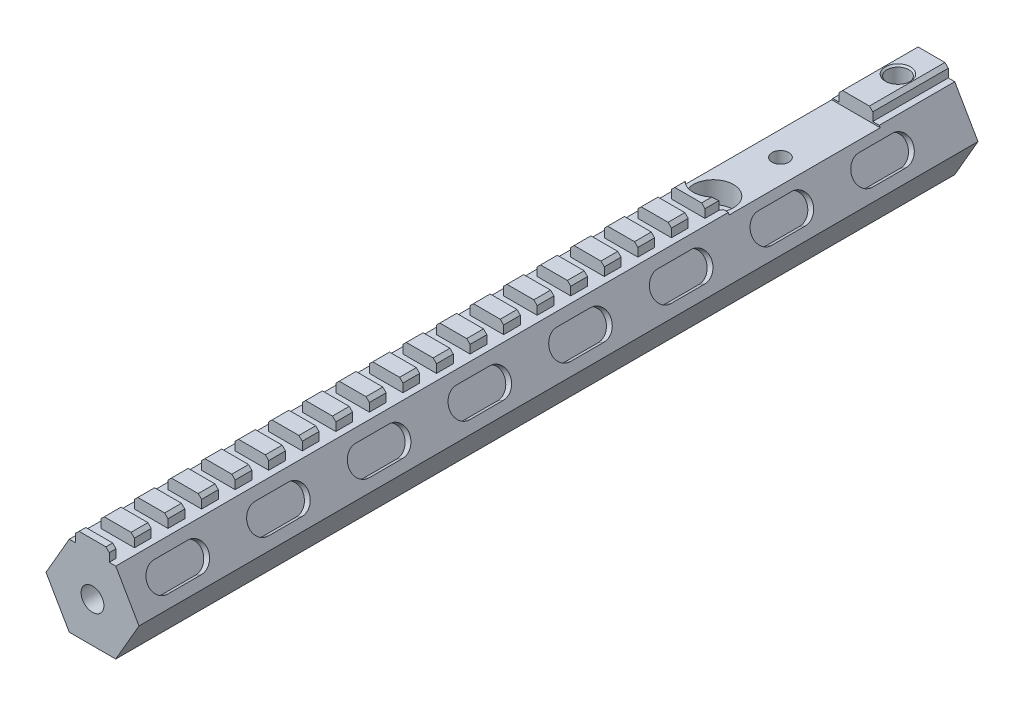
from build123d import *

# Parameters (mm, degrees)
EXTRUDE_1_DEPTH          = 250
SKETCH_2_W               = 10
SKETCH_2_H               = 7
EXTRUDE_2_DEPTH          = 22.5
CHAMFER_3_SIZE           = 1
EXTRUDE_START            = -67.5
EXTRUDE_3_DEPTH          = 5
PATTERN_LINEAR_1_COUNT   = 18
PATTERN_LINEAR_1_PITCH   = 10
EXTRUDE_START_2          = 7.5
EXTRUDE_4_DEPTH          = 2
CUT_EXTRUDE_1_DEPTH      = 2
PATTERN_LINEAR_2_COUNT   = 8
PATTERN_LINEAR_2_PITCH   = 30
MIRROR_1_COPY_1_DEPTH    = 2
MIRROR_1_COPY_2_DEPTH    = 2
MIRROR_1_COPY_3_DEPTH    = 2
MIRROR_1_COPY_4_DEPTH    = 2
MIRROR_1_COPY_5_DEPTH    = 2
MIRROR_1_COPY_6_DEPTH    = 2
MIRROR_1_COPY_7_DEPTH    = 2
CUT_EXTRUDE_2_DEPTH      = 21
CUT_EXTRUDE_3_REACH      = 253.889
SKETCH_12_R              = 3.25
CHAMFER_5_SIZE           = 0.5
HOLE_WIZARD_M8_1_D       = 6.8
HOLE_WIZARD_M8_1_DEPTH   = 25
HOLE_WIZARD_M8_1_TIP     = 2.042926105
HOLE_WIZARD_M6_1_D       = 5
HOLE_WIZARD_M6_1_DEPTH   = 15
HOLE_WIZARD_M6_1_TIP     = 1.502151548
CUT_EXTRUDE_4_DEPTH      = 251.863010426
CUT_EXTRUDE_4_DEPTH_BACK = 251.863010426
HOLE_WIZARD_M6_2_D       = 5
HOLE_WIZARD_M6_2_DEPTH   = 15
HOLE_WIZARD_M6_2_TIP     = 1.502151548


with BuildPart() as part:
    # Sketch 1 → Extrude 1 (new body)
    with BuildSketch(Plane.XY):
        Polygon((-13.856406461, 0), (-6.92820323, -12), (6.92820323, -12), (13.856406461, 0), (6.92820323, 12), (-6.92820323, 12), align=None)
    extrude(amount=EXTRUDE_1_DEPTH)

    # Sketch 2 → Extrude 2 (add)
    with BuildSketch(Plane.XY):
        with Locations((0, 12)):
            Rectangle(SKETCH_2_W, SKETCH_2_H)
    extrude(amount=EXTRUDE_2_DEPTH)

    # Chamfer 3
    chamfer_3_edges = [part.edges().sort_by_distance(p)[0] for p in [
        (-5, 15.5, 11.25),
        (5, 15.5, 11.25),
    ]]
    chamfer(chamfer_3_edges, length=CHAMFER_3_SIZE)

    # Sketch 7 → Extrude 3 (add)
    with BuildSketch(Plane(origin=(0, 0, 0), x_dir=(-1, 0, 0), z_dir=(0, 0, -1)).offset(EXTRUDE_START)):
        Polygon((-5, 12), (5, 12), (5, 14.5), (4, 15.5), (-4, 15.5), (-5, 14.5), align=None)
    extrude_3 = extrude(amount=-EXTRUDE_3_DEPTH)

    # Pattern Linear 1: Extrude 3 ×18
    with Locations(*[(0, 0, i * PATTERN_LINEAR_1_PITCH) for i in range(1, PATTERN_LINEAR_1_COUNT)]):
        add(extrude_3)

    # Sketch 8 → Extrude 4 (add)
    with BuildSketch(Plane.XY.offset(242.5).offset(EXTRUDE_START_2)):
        Polygon((5, 12), (5, 14.5), (4, 15.5), (-4, 15.5), (-5, 14.5), (-5, 12), align=None)
    extrude(amount=-EXTRUDE_4_DEPTH)

    # Sketch 10 → Cut-Extrude 1 (cut)
    with BuildSketch(Plane(origin=(-10.392304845, 6, 0), x_dir=(0, 0, 1), z_dir=(-0.8660254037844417, 0.49999999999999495, 0))):
        with BuildLine():
            Line((20, 3.97179677), (30, 3.97179677))
            ThreePointArc((30, 3.97179677), (34, -0.02820323), (30, -4.02820323))
            Line((30, -4.02820323), (20, -4.02820323))
            ThreePointArc((20, -4.02820323), (16, -0.02820323), (20, 3.97179677))
        make_face()
    cut_extrude_1 = extrude(amount=-CUT_EXTRUDE_1_DEPTH, mode=Mode.SUBTRACT)

    # Pattern Linear 2: Cut-Extrude 1 ×8
    with Locations(*[(0, 0, i * PATTERN_LINEAR_2_PITCH) for i in range(1, PATTERN_LINEAR_2_COUNT)]):
        add(cut_extrude_1, mode=Mode.SUBTRACT)

    # Mirror 1: Cut-Extrude 1 across plane
    add(cut_extrude_1.mirror(Plane(origin=(0, 0, 0), x_dir=(0, 0, 1), z_dir=(1, 0, 0))), mode=Mode.SUBTRACT)

    # Mirror 1 copy 1 sketch → Mirror 1 copy 1 (cut)
    with BuildSketch(Plane(origin=(10.392304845, 6, 30), x_dir=(0, 0, 1), z_dir=(0.8660254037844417, 0.49999999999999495, 0))):
        with BuildLine():
            Line((20, -3.97179677), (30, -3.97179677))
            ThreePointArc((30, -3.97179677), (34, 0.02820323), (30, 4.02820323))
            Line((30, 4.02820323), (20, 4.02820323))
            ThreePointArc((20, 4.02820323), (16, 0.02820323), (20, -3.97179677))
        make_face()
    extrude(amount=-MIRROR_1_COPY_1_DEPTH, mode=Mode.SUBTRACT)

    # Mirror 1 copy 2 sketch → Mirror 1 copy 2 (cut)
    with BuildSketch(Plane(origin=(10.392304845, 6, 60), x_dir=(0, 0, 1), z_dir=(0.8660254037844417, 0.49999999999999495, 0))):
        with BuildLine():
            Line((20, -3.97179677), (30, -3.97179677))
            ThreePointArc((30, -3.97179677), (34, 0.02820323), (30, 4.02820323))
            Line((30, 4.02820323), (20, 4.02820323))
            ThreePointArc((20, 4.02820323), (16, 0.02820323), (20, -3.97179677))
        make_face()
    extrude(amount=-MIRROR_1_COPY_2_DEPTH, mode=Mode.SUBTRACT)

    # Mirror 1 copy 3 sketch → Mirror 1 copy 3 (cut)
    with BuildSketch(Plane(origin=(10.392304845, 6, 90), x_dir=(0, 0, 1), z_dir=(0.8660254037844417, 0.49999999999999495, 0))):
        with BuildLine():
            Line((20, -3.97179677), (30, -3.97179677))
            ThreePointArc((30, -3.97179677), (34, 0.02820323), (30, 4.02820323))
            Line((30, 4.02820323), (20, 4.02820323))
            ThreePointArc((20, 4.02820323), (16, 0.02820323), (20, -3.97179677))
        make_face()
    extrude(amount=-MIRROR_1_COPY_3_DEPTH, mode=Mode.SUBTRACT)

    # Mirror 1 copy 4 sketch → Mirror 1 copy 4 (cut)
    with BuildSketch(Plane(origin=(10.392304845, 6, 120), x_dir=(0, 0, 1), z_dir=(0.8660254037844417, 0.49999999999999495, 0))):
        with BuildLine():
            Line((20, -3.97179677), (30, -3.97179677))
            ThreePointArc((30, -3.97179677), (34, 0.02820323), (30, 4.02820323))
            Line((30, 4.02820323), (20, 4.02820323))
            ThreePointArc((20, 4.02820323), (16, 0.02820323), (20, -3.97179677))
        make_face()
    extrude(amount=-MIRROR_1_COPY_4_DEPTH, mode=Mode.SUBTRACT)

    # Mirror 1 copy 5 sketch → Mirror 1 copy 5 (cut)
    with BuildSketch(Plane(origin=(10.392304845, 6, 150), x_dir=(0, 0, 1), z_dir=(0.8660254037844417, 0.49999999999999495, 0))):
        with BuildLine():
            Line((20, -3.97179677), (30, -3.97179677))
            ThreePointArc((30, -3.97179677), (34, 0.02820323), (30, 4.02820323))
            Line((30, 4.02820323), (20, 4.02820323))
            ThreePointArc((20, 4.02820323), (16, 0.02820323), (20, -3.97179677))
        make_face()
    extrude(amount=-MIRROR_1_COPY_5_DEPTH, mode=Mode.SUBTRACT)

    # Mirror 1 copy 6 sketch → Mirror 1 copy 6 (cut)
    with BuildSketch(Plane(origin=(10.392304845, 6, 180), x_dir=(0, 0, 1), z_dir=(0.8660254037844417, 0.49999999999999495, 0))):
        with BuildLine():
            Line((20, -3.97179677), (30, -3.97179677))
            ThreePointArc((30, -3.97179677), (34, 0.02820323), (30, 4.02820323))
            Line((30, 4.02820323), (20, 4.02820323))
            ThreePointArc((20, 4.02820323), (16, 0.02820323), (20, -3.97179677))
        make_face()
    extrude(amount=-MIRROR_1_COPY_6_DEPTH, mode=Mode.SUBTRACT)

    # Mirror 1 copy 7 sketch → Mirror 1 copy 7 (cut)
    with BuildSketch(Plane(origin=(10.392304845, 6, 210), x_dir=(0, 0, 1), z_dir=(0.8660254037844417, 0.49999999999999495, 0))):
        with BuildLine():
            Line((20, -3.97179677), (30, -3.97179677))
            ThreePointArc((30, -3.97179677), (34, 0.02820323), (30, 4.02820323))
            Line((30, 4.02820323), (20, 4.02820323))
            ThreePointArc((20, 4.02820323), (16, 0.02820323), (20, -3.97179677))
        make_face()
    extrude(amount=-MIRROR_1_COPY_7_DEPTH, mode=Mode.SUBTRACT)

    # Sketch 11 → Cut-Extrude 2 (cut)
    with BuildSketch(Plane(origin=(0, 0, 0), x_dir=(-1, 0, 0), z_dir=(0, 0, -1))):
        with BuildLine():
            Line((-3.620773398, 6.7), (3.620773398, 6.7))
            ThreePointArc((3.620773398, 6.7), (6.301724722, 5.920485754), (8.146740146, 3.825))
            ThreePointArc((8.146740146, 3.825), (0, -9), (-8.146740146, 3.825))
            ThreePointArc((-8.146740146, 3.825), (-6.301724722, 5.920485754), (-3.620773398, 6.7))
        make_face()
    extrude(amount=-CUT_EXTRUDE_2_DEPTH, mode=Mode.SUBTRACT)

    # Sketch 12 → Cut-Extrude 3 (cut, up to next)
    with BuildSketch(Plane(origin=(0, 15.5, 0), x_dir=(1, 0, 0), z_dir=(0, 1, 0)), mode=Mode.PRIVATE) as cut_extrude_3_sk1:
        with Locations(Location((0, -10, 0), (0, 0, 270))):
            Circle(SKETCH_12_R)
    cut_extrude_3_tool1 = extrude(cut_extrude_3_sk1.sketch, amount=-CUT_EXTRUDE_3_REACH, mode=Mode.PRIVATE) & part.part
    add(cut_extrude_3_tool1.solids().sort_by_distance((0, 15.5, 10))[0], mode=Mode.SUBTRACT)

    # Chamfer 5
    chamfer_5_edges = [part.edges().sort_by_distance(p)[0] for p in [
        (0, 15.5, 6.75),
    ]]
    chamfer(chamfer_5_edges, length=CHAMFER_5_SIZE)

    # Hole Wizard M8 _1
    with Locations(Plane.XY.offset(250)):
        with Locations((0, 0)):
            Hole(HOLE_WIZARD_M8_1_D / 2, depth=HOLE_WIZARD_M8_1_DEPTH)
            with Locations((0, 0, -(HOLE_WIZARD_M8_1_DEPTH + HOLE_WIZARD_M8_1_TIP / 2))):  # 118° drill point
                Cone(0, HOLE_WIZARD_M8_1_D / 2, HOLE_WIZARD_M8_1_TIP, mode=Mode.SUBTRACT)

    # Hole Wizard M6 _1
    with Locations(Plane(origin=(0, -12, 0), x_dir=(-1, 0, 0), z_dir=(0, -1, 0))):
        with Locations((0, -170)):
            Hole(HOLE_WIZARD_M6_1_D / 2, depth=HOLE_WIZARD_M6_1_DEPTH)
            with Locations((0, 0, -(HOLE_WIZARD_M6_1_DEPTH + HOLE_WIZARD_M6_1_TIP / 2))):  # 118° drill point
                Cone(0, HOLE_WIZARD_M6_1_D / 2, HOLE_WIZARD_M6_1_TIP, mode=Mode.SUBTRACT)

    # Sketch 20 → Cut-Extrude 4 (cut, two sides: drawn at the far end of the back side and taken through both)
    with BuildSketch(Plane(origin=(0, 0, 0), x_dir=(0, 0, -1), z_dir=(1, 0, 0)).offset(-CUT_EXTRUDE_4_DEPTH_BACK)):
        Polygon((-22.5, 479.524862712), (-22.5, 12), (-22.5, 11.5), (-67.5, 11.5), (-67.5, 12), (-67.5, 479.524862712), (-67.5, 1414.574588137), (-22.5, 1414.574588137), align=None)
    extrude(amount=CUT_EXTRUDE_4_DEPTH + CUT_EXTRUDE_4_DEPTH_BACK, mode=Mode.SUBTRACT)

    # Sketch 17 → Cut-Revolve 1 (revolve, cut)
    with BuildSketch(Plane(origin=(0, 0, 0), x_dir=(0, 0, -1), z_dir=(1, 0, 0)), mode=Mode.PRIVATE) as cut_revolve_1_sk:
        Polygon((-65, 21.045627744), (-59, 21.045627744), (-59, 5.045627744), (-61.322523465, 5.045627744), (-61.322523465, -16.413920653), (-65, -16.413920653), align=None)
    revolve(cut_revolve_1_sk.sketch.rotate(Axis((0, 33.000726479, 65), (0, -1, 0)), 180), axis=Axis((0, 33.000726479, 65), (0, -1, 0)), mode=Mode.SUBTRACT)

    # Hole Wizard M6 _2
    with Locations(Plane(origin=(0, 11.5, 0), x_dir=(1, 0, 0), z_dir=(0, 1, 0))):
        with Locations((0, -45)):
            Hole(HOLE_WIZARD_M6_2_D / 2, depth=HOLE_WIZARD_M6_2_DEPTH)
            with Locations((0, 0, -(HOLE_WIZARD_M6_2_DEPTH + HOLE_WIZARD_M6_2_TIP / 2))):  # 118° drill point
                Cone(0, HOLE_WIZARD_M6_2_D / 2, HOLE_WIZARD_M6_2_TIP, mode=Mode.SUBTRACT)


solid = part.part
